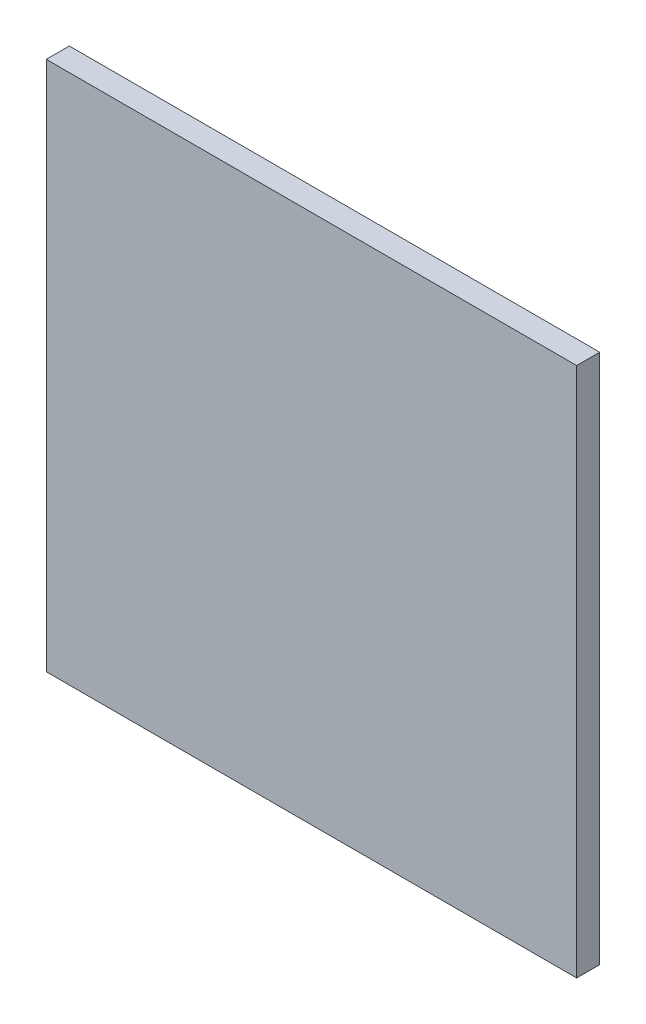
ISO-10303-21;
HEADER;
FILE_DESCRIPTION(('STEP AP214'),'2;1');
FILE_NAME('part.step','',(''),(''),'','','');
FILE_SCHEMA(('AUTOMOTIVE_DESIGN { 1 0 10303 214 1 1 1 1 }'));
ENDSEC;
DATA;
#1=APPLICATION_CONTEXT('core data for automotive mechanical design processes');
#2=APPLICATION_PROTOCOL_DEFINITION('international standard','automotive_design',2000,#1);
#3=PRODUCT_CONTEXT('',#1,'mechanical');
#4=PRODUCT('Part','Part','',(#3));
#5=PRODUCT_RELATED_PRODUCT_CATEGORY('part','',(#4));
#6=PRODUCT_DEFINITION_FORMATION('','',#4);
#7=PRODUCT_DEFINITION_CONTEXT('part definition',#1,'design');
#8=PRODUCT_DEFINITION('design','',#6,#7);
#9=PRODUCT_DEFINITION_SHAPE('','',#8);
#10=(LENGTH_UNIT() NAMED_UNIT(*) SI_UNIT(.MILLI.,.METRE.));
#11=(NAMED_UNIT(*) PLANE_ANGLE_UNIT() SI_UNIT($,.RADIAN.));
#12=(NAMED_UNIT(*) SI_UNIT($,.STERADIAN.) SOLID_ANGLE_UNIT());
#13=UNCERTAINTY_MEASURE_WITH_UNIT(LENGTH_MEASURE(1.E-05),#10,'distance_accuracy_value','');
#14=(GEOMETRIC_REPRESENTATION_CONTEXT(3) GLOBAL_UNCERTAINTY_ASSIGNED_CONTEXT((#13)) GLOBAL_UNIT_ASSIGNED_CONTEXT((#10,
#11,#12)) REPRESENTATION_CONTEXT('',''));
#15=CARTESIAN_POINT('',(0.,0.,0.));
#16=DIRECTION('',(0.,0.,1.));
#17=DIRECTION('',(1.,0.,0.));
#18=AXIS2_PLACEMENT_3D('',#15,#16,#17);
#19=CARTESIAN_POINT('',(-92.,-92.,8.));
#20=DIRECTION('',(1.,0.,0.));
#21=DIRECTION('',(0.,0.,-1.));
#22=AXIS2_PLACEMENT_3D('',#19,#20,#21);
#23=PLANE('',#22);
#24=DIRECTION('',(0.,-1.,0.));
#25=VECTOR('',#24,1.);
#26=CARTESIAN_POINT('',(-92.,-92.,0.));
#27=LINE('',#26,#25);
#28=CARTESIAN_POINT('',(-92.,92.,0.));
#29=VERTEX_POINT('',#28);
#30=CARTESIAN_POINT('',(-92.,-92.,0.));
#31=VERTEX_POINT('',#30);
#32=EDGE_CURVE('E104',#29,#31,#27,.T.);
#33=ORIENTED_EDGE('',*,*,#32,.T.);
#34=DIRECTION('',(0.,0.,-1.));
#35=VECTOR('',#34,1.);
#36=CARTESIAN_POINT('',(-92.,-92.,8.));
#37=LINE('',#36,#35);
#38=CARTESIAN_POINT('',(-92.,-92.,8.));
#39=VERTEX_POINT('',#38);
#40=EDGE_CURVE('E11',#39,#31,#37,.T.);
#41=ORIENTED_EDGE('',*,*,#40,.F.);
#42=DIRECTION('',(0.,-1.,0.));
#43=VECTOR('',#42,1.);
#44=CARTESIAN_POINT('',(-92.,-92.,8.));
#45=LINE('',#44,#43);
#46=CARTESIAN_POINT('',(-92.,92.,8.));
#47=VERTEX_POINT('',#46);
#48=EDGE_CURVE('E92',#47,#39,#45,.T.);
#49=ORIENTED_EDGE('',*,*,#48,.F.);
#50=DIRECTION('',(0.,0.,-1.));
#51=VECTOR('',#50,1.);
#52=CARTESIAN_POINT('',(-92.,92.,8.));
#53=LINE('',#52,#51);
#54=EDGE_CURVE('E100',#47,#29,#53,.T.);
#55=ORIENTED_EDGE('',*,*,#54,.T.);
#56=EDGE_LOOP('',(#33,#41,#49,#55));
#57=FACE_BOUND('',#56,.T.);
#58=ADVANCED_FACE('F41',(#57),#23,.F.);
#59=CARTESIAN_POINT('',(92.,-92.,8.));
#60=DIRECTION('',(0.,1.,0.));
#61=DIRECTION('',(-1.,0.,0.));
#62=AXIS2_PLACEMENT_3D('',#59,#60,#61);
#63=PLANE('',#62);
#64=DIRECTION('',(1.,0.,0.));
#65=VECTOR('',#64,1.);
#66=CARTESIAN_POINT('',(92.,-92.,0.));
#67=LINE('',#66,#65);
#68=CARTESIAN_POINT('',(92.,-92.,0.));
#69=VERTEX_POINT('',#68);
#70=EDGE_CURVE('E96',#31,#69,#67,.T.);
#71=ORIENTED_EDGE('',*,*,#70,.T.);
#72=DIRECTION('',(0.,0.,-1.));
#73=VECTOR('',#72,1.);
#74=CARTESIAN_POINT('',(92.,-92.,8.));
#75=LINE('',#74,#73);
#76=CARTESIAN_POINT('',(92.,-92.,8.));
#77=VERTEX_POINT('',#76);
#78=EDGE_CURVE('E49',#77,#69,#75,.T.);
#79=ORIENTED_EDGE('',*,*,#78,.F.);
#80=DIRECTION('',(1.,0.,0.));
#81=VECTOR('',#80,1.);
#82=CARTESIAN_POINT('',(92.,-92.,8.));
#83=LINE('',#82,#81);
#84=EDGE_CURVE('E87',#39,#77,#83,.T.);
#85=ORIENTED_EDGE('',*,*,#84,.F.);
#86=ORIENTED_EDGE('',*,*,#40,.T.);
#87=EDGE_LOOP('',(#71,#79,#85,#86));
#88=FACE_BOUND('',#87,.T.);
#89=ADVANCED_FACE('F95',(#88),#63,.F.);
#90=CARTESIAN_POINT('',(92.,-92.,8.));
#91=DIRECTION('',(-1.,0.,0.));
#92=DIRECTION('',(0.,0.,1.));
#93=AXIS2_PLACEMENT_3D('',#90,#91,#92);
#94=PLANE('',#93);
#95=DIRECTION('',(0.,1.,0.));
#96=VECTOR('',#95,1.);
#97=CARTESIAN_POINT('',(92.,-92.,0.));
#98=LINE('',#97,#96);
#99=CARTESIAN_POINT('',(92.,92.,0.));
#100=VERTEX_POINT('',#99);
#101=EDGE_CURVE('E74',#69,#100,#98,.T.);
#102=ORIENTED_EDGE('',*,*,#101,.T.);
#103=DIRECTION('',(0.,0.,-1.));
#104=VECTOR('',#103,1.);
#105=CARTESIAN_POINT('',(92.,92.,8.));
#106=LINE('',#105,#104);
#107=CARTESIAN_POINT('',(92.,92.,8.));
#108=VERTEX_POINT('',#107);
#109=EDGE_CURVE('E97',#108,#100,#106,.T.);
#110=ORIENTED_EDGE('',*,*,#109,.F.);
#111=DIRECTION('',(0.,1.,0.));
#112=VECTOR('',#111,1.);
#113=CARTESIAN_POINT('',(92.,-92.,8.));
#114=LINE('',#113,#112);
#115=EDGE_CURVE('E90',#77,#108,#114,.T.);
#116=ORIENTED_EDGE('',*,*,#115,.F.);
#117=ORIENTED_EDGE('',*,*,#78,.T.);
#118=EDGE_LOOP('',(#102,#110,#116,#117));
#119=FACE_BOUND('',#118,.T.);
#120=ADVANCED_FACE('F98',(#119),#94,.F.);
#121=CARTESIAN_POINT('',(92.,92.,8.));
#122=DIRECTION('',(0.,-1.,0.));
#123=DIRECTION('',(1.,0.,0.));
#124=AXIS2_PLACEMENT_3D('',#121,#122,#123);
#125=PLANE('',#124);
#126=DIRECTION('',(-1.,0.,0.));
#127=VECTOR('',#126,1.);
#128=CARTESIAN_POINT('',(92.,92.,0.));
#129=LINE('',#128,#127);
#130=EDGE_CURVE('E80',#100,#29,#129,.T.);
#131=ORIENTED_EDGE('',*,*,#130,.T.);
#132=ORIENTED_EDGE('',*,*,#54,.F.);
#133=DIRECTION('',(-1.,0.,0.));
#134=VECTOR('',#133,1.);
#135=CARTESIAN_POINT('',(92.,92.,8.));
#136=LINE('',#135,#134);
#137=EDGE_CURVE('E57',#108,#47,#136,.T.);
#138=ORIENTED_EDGE('',*,*,#137,.F.);
#139=ORIENTED_EDGE('',*,*,#109,.T.);
#140=EDGE_LOOP('',(#131,#132,#138,#139));
#141=FACE_BOUND('',#140,.T.);
#142=ADVANCED_FACE('F111',(#141),#125,.F.);
#143=CARTESIAN_POINT('',(0.,0.,8.));
#144=DIRECTION('',(0.,0.,1.));
#145=DIRECTION('',(1.,0.,0.));
#146=AXIS2_PLACEMENT_3D('',#143,#144,#145);
#147=PLANE('',#146);
#148=ORIENTED_EDGE('',*,*,#48,.T.);
#149=ORIENTED_EDGE('',*,*,#84,.T.);
#150=ORIENTED_EDGE('',*,*,#115,.T.);
#151=ORIENTED_EDGE('',*,*,#137,.T.);
#152=EDGE_LOOP('',(#148,#149,#150,#151));
#153=FACE_BOUND('',#152,.T.);
#154=ADVANCED_FACE('F88',(#153),#147,.T.);
#155=CARTESIAN_POINT('',(0.,0.,0.));
#156=DIRECTION('',(0.,0.,1.));
#157=DIRECTION('',(1.,0.,0.));
#158=AXIS2_PLACEMENT_3D('',#155,#156,#157);
#159=PLANE('',#158);
#160=ORIENTED_EDGE('',*,*,#32,.F.);
#161=ORIENTED_EDGE('',*,*,#130,.F.);
#162=ORIENTED_EDGE('',*,*,#101,.F.);
#163=ORIENTED_EDGE('',*,*,#70,.F.);
#164=EDGE_LOOP('',(#160,#161,#162,#163));
#165=FACE_BOUND('',#164,.T.);
#166=ADVANCED_FACE('F114',(#165),#159,.F.);
#167=CLOSED_SHELL('',(#58,#89,#120,#142,#154,#166));
#168=MANIFOLD_SOLID_BREP('B2',#167);
#169=ADVANCED_BREP_SHAPE_REPRESENTATION('',(#18,#168),#14);
#170=SHAPE_DEFINITION_REPRESENTATION(#9,#169);
ENDSEC;
END-ISO-10303-21;
